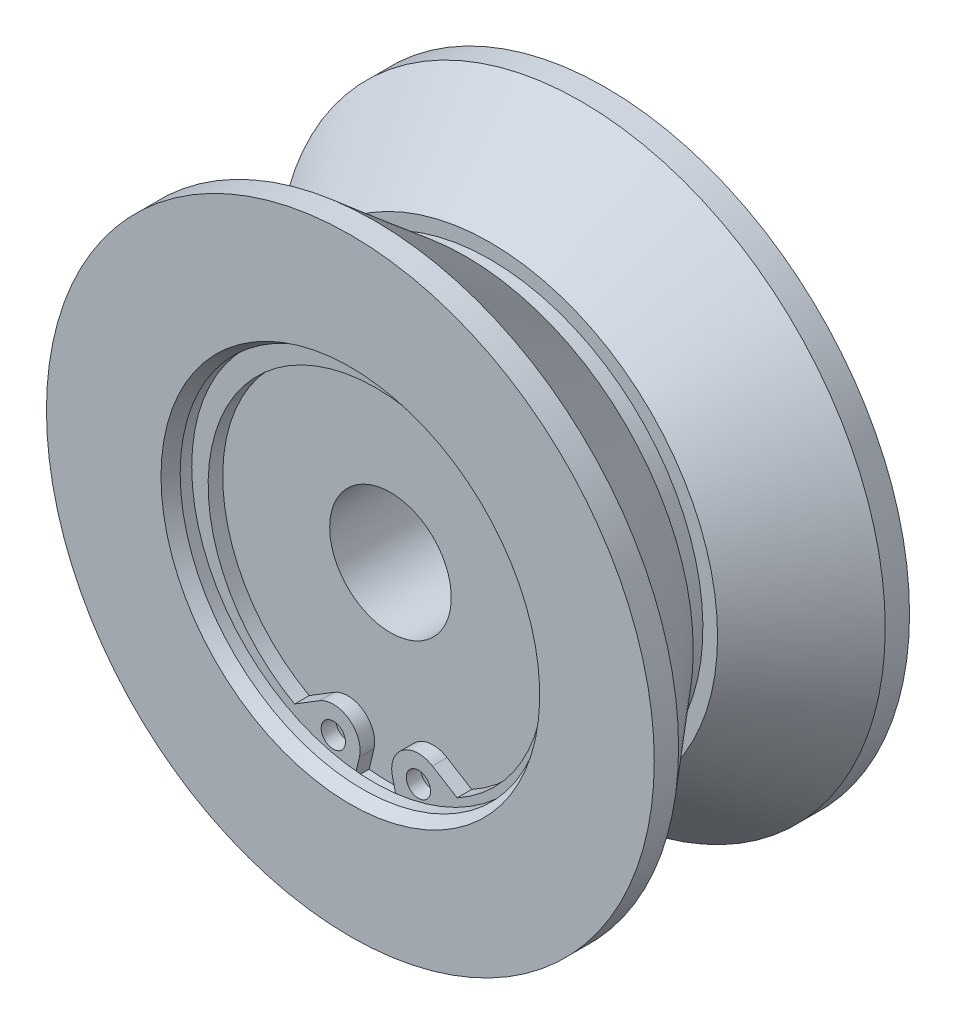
ISO-10303-21;
HEADER;
FILE_DESCRIPTION(('STEP AP214'),'2;1');
FILE_NAME('part.step','',(''),(''),'','','');
FILE_SCHEMA(('AUTOMOTIVE_DESIGN { 1 0 10303 214 1 1 1 1 }'));
ENDSEC;
DATA;
#1=APPLICATION_CONTEXT('core data for automotive mechanical design processes');
#2=APPLICATION_PROTOCOL_DEFINITION('international standard','automotive_design',2000,#1);
#3=PRODUCT_CONTEXT('',#1,'mechanical');
#4=PRODUCT('Part','Part','',(#3));
#5=PRODUCT_RELATED_PRODUCT_CATEGORY('part','',(#4));
#6=PRODUCT_DEFINITION_FORMATION('','',#4);
#7=PRODUCT_DEFINITION_CONTEXT('part definition',#1,'design');
#8=PRODUCT_DEFINITION('design','',#6,#7);
#9=PRODUCT_DEFINITION_SHAPE('','',#8);
#10=(LENGTH_UNIT() NAMED_UNIT(*) SI_UNIT(.MILLI.,.METRE.));
#11=(NAMED_UNIT(*) PLANE_ANGLE_UNIT() SI_UNIT($,.RADIAN.));
#12=(NAMED_UNIT(*) SI_UNIT($,.STERADIAN.) SOLID_ANGLE_UNIT());
#13=UNCERTAINTY_MEASURE_WITH_UNIT(LENGTH_MEASURE(1.E-05),#10,'distance_accuracy_value','');
#14=(GEOMETRIC_REPRESENTATION_CONTEXT(3) GLOBAL_UNCERTAINTY_ASSIGNED_CONTEXT((#13)) GLOBAL_UNIT_ASSIGNED_CONTEXT((#10,
#11,#12)) REPRESENTATION_CONTEXT('',''));
#15=CARTESIAN_POINT('',(0.,0.,0.));
#16=DIRECTION('',(0.,0.,1.));
#17=DIRECTION('',(1.,0.,0.));
#18=AXIS2_PLACEMENT_3D('',#15,#16,#17);
#19=CARTESIAN_POINT('',(0.,-0.75,8.4));
#20=DIRECTION('',(0.,0.,1.));
#21=DIRECTION('',(-1.,0.,0.));
#22=AXIS2_PLACEMENT_3D('',#19,#20,#21);
#23=CYLINDRICAL_SURFACE('',#22,13.8);
#24=CARTESIAN_POINT('',(0.,-0.75,7.2));
#25=DIRECTION('',(0.,0.,-1.));
#26=DIRECTION('',(0.,-1.,0.));
#27=AXIS2_PLACEMENT_3D('',#24,#25,#26);
#28=CIRCLE('',#27,13.8);
#29=CARTESIAN_POINT('',(-6.68514847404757,-12.8226463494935,7.2));
#30=VERTEX_POINT('',#29);
#31=CARTESIAN_POINT('',(6.68514847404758,-12.8226463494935,7.2));
#32=VERTEX_POINT('',#31);
#33=EDGE_CURVE('E105',#30,#32,#28,.T.);
#34=ORIENTED_EDGE('',*,*,#33,.T.);
#35=DIRECTION('',(0.,0.,-1.));
#36=VECTOR('',#35,1.);
#37=CARTESIAN_POINT('',(6.68514847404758,-12.8226463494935,8.4));
#38=LINE('',#37,#36);
#39=CARTESIAN_POINT('',(6.68514847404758,-12.8226463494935,8.4));
#40=VERTEX_POINT('',#39);
#41=EDGE_CURVE('E121',#40,#32,#38,.T.);
#42=ORIENTED_EDGE('',*,*,#41,.F.);
#43=CARTESIAN_POINT('',(0.,-0.75,8.4));
#44=DIRECTION('',(0.,0.,-1.));
#45=DIRECTION('',(0.,-1.,0.));
#46=AXIS2_PLACEMENT_3D('',#43,#44,#45);
#47=CIRCLE('',#46,13.8);
#48=CARTESIAN_POINT('',(-6.68514847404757,-12.8226463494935,8.4));
#49=VERTEX_POINT('',#48);
#50=EDGE_CURVE('E116',#49,#40,#47,.T.);
#51=ORIENTED_EDGE('',*,*,#50,.F.);
#52=DIRECTION('',(0.,0.,-1.));
#53=VECTOR('',#52,1.);
#54=CARTESIAN_POINT('',(-6.68514847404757,-12.8226463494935,8.4));
#55=LINE('',#54,#53);
#56=EDGE_CURVE('E96',#49,#30,#55,.T.);
#57=ORIENTED_EDGE('',*,*,#56,.T.);
#58=EDGE_LOOP('',(#34,#42,#51,#57));
#59=FACE_BOUND('',#58,.T.);
#60=ADVANCED_FACE('F14',(#59),#23,.F.);
#61=CARTESIAN_POINT('',(4.6535366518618,-11.5716426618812,8.4));
#62=DIRECTION('',(-0.524334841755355,-0.851512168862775,0.));
#63=DIRECTION('',(-0.851512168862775,0.524334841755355,0.));
#64=AXIS2_PLACEMENT_3D('',#61,#62,#63);
#65=PLANE('',#64);
#66=DIRECTION('',(-0.851512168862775,0.524334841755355,0.));
#67=VECTOR('',#66,1.);
#68=CARTESIAN_POINT('',(4.6535366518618,-11.5716426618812,7.2));
#69=LINE('',#68,#67);
#70=CARTESIAN_POINT('',(4.6535366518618,-11.5716426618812,7.2));
#71=VERTEX_POINT('',#70);
#72=EDGE_CURVE('E109',#32,#71,#69,.T.);
#73=ORIENTED_EDGE('',*,*,#72,.T.);
#74=DIRECTION('',(0.,0.,-1.));
#75=VECTOR('',#74,1.);
#76=CARTESIAN_POINT('',(4.6535366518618,-11.5716426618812,8.4));
#77=LINE('',#76,#75);
#78=CARTESIAN_POINT('',(4.6535366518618,-11.5716426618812,8.4));
#79=VERTEX_POINT('',#78);
#80=EDGE_CURVE('E140',#79,#71,#77,.T.);
#81=ORIENTED_EDGE('',*,*,#80,.F.);
#82=DIRECTION('',(-0.851512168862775,0.524334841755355,0.));
#83=VECTOR('',#82,1.);
#84=CARTESIAN_POINT('',(4.6535366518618,-11.5716426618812,8.4));
#85=LINE('',#84,#83);
#86=EDGE_CURVE('E143',#40,#79,#85,.T.);
#87=ORIENTED_EDGE('',*,*,#86,.F.);
#88=ORIENTED_EDGE('',*,*,#41,.T.);
#89=EDGE_LOOP('',(#73,#81,#87,#88));
#90=FACE_BOUND('',#89,.T.);
#91=ADVANCED_FACE('F279',(#90),#65,.F.);
#92=CARTESIAN_POINT('',(3.5,-13.4449694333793,8.4));
#93=DIRECTION('',(0.,0.,1.));
#94=DIRECTION('',(-1.,0.,0.));
#95=AXIS2_PLACEMENT_3D('',#92,#93,#94);
#96=CYLINDRICAL_SURFACE('',#95,2.2);
#97=CARTESIAN_POINT('',(3.5,-13.4449694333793,7.2));
#98=DIRECTION('',(0.,0.,1.));
#99=DIRECTION('',(1.,0.,0.));
#100=AXIS2_PLACEMENT_3D('',#97,#98,#99);
#101=CIRCLE('',#100,2.2);
#102=CARTESIAN_POINT('',(1.35968434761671,-13.9539379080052,7.2));
#103=VERTEX_POINT('',#102);
#104=EDGE_CURVE('E134',#71,#103,#101,.T.);
#105=ORIENTED_EDGE('',*,*,#104,.T.);
#106=DIRECTION('',(0.,0.,-1.));
#107=VECTOR('',#106,1.);
#108=CARTESIAN_POINT('',(1.35968434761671,-13.9539379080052,8.4));
#109=LINE('',#108,#107);
#110=CARTESIAN_POINT('',(1.35968434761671,-13.9539379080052,8.4));
#111=VERTEX_POINT('',#110);
#112=EDGE_CURVE('E144',#111,#103,#109,.T.);
#113=ORIENTED_EDGE('',*,*,#112,.F.);
#114=CARTESIAN_POINT('',(3.5,-13.4449694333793,8.4));
#115=DIRECTION('',(0.,0.,1.));
#116=DIRECTION('',(1.,0.,0.));
#117=AXIS2_PLACEMENT_3D('',#114,#115,#116);
#118=CIRCLE('',#117,2.2);
#119=EDGE_CURVE('E163',#79,#111,#118,.T.);
#120=ORIENTED_EDGE('',*,*,#119,.F.);
#121=ORIENTED_EDGE('',*,*,#80,.T.);
#122=EDGE_LOOP('',(#105,#113,#120,#121));
#123=FACE_BOUND('',#122,.T.);
#124=ADVANCED_FACE('F284',(#123),#96,.T.);
#125=CARTESIAN_POINT('',(-1.3596843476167,-13.9539379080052,8.4));
#126=DIRECTION('',(-0.97287075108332,0.231349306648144,0.));
#127=DIRECTION('',(0.,0.,1.));
#128=AXIS2_PLACEMENT_3D('',#125,#126,#127);
#129=PLANE('',#128);
#130=DIRECTION('',(0.,0.,-1.));
#131=VECTOR('',#130,1.);
#132=CARTESIAN_POINT('',(-1.7515909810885,-15.6019847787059,-11.5));
#133=LINE('',#132,#131);
#134=CARTESIAN_POINT('',(-1.7515909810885,-15.6019847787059,7.2));
#135=VERTEX_POINT('',#134);
#136=CARTESIAN_POINT('',(-1.7515909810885,-15.6019847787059,8.4));
#137=VERTEX_POINT('',#136);
#138=EDGE_CURVE('E102',#135,#137,#133,.F.);
#139=ORIENTED_EDGE('',*,*,#138,.F.);
#140=DIRECTION('',(0.231349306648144,0.97287075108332,0.));
#141=VECTOR('',#140,1.);
#142=CARTESIAN_POINT('',(-1.3596843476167,-13.9539379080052,7.2));
#143=LINE('',#142,#141);
#144=CARTESIAN_POINT('',(-1.3596843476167,-13.9539379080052,7.2));
#145=VERTEX_POINT('',#144);
#146=EDGE_CURVE('E147',#135,#145,#143,.T.);
#147=ORIENTED_EDGE('',*,*,#146,.T.);
#148=DIRECTION('',(0.,0.,-1.));
#149=VECTOR('',#148,1.);
#150=CARTESIAN_POINT('',(-1.3596843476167,-13.9539379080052,8.4));
#151=LINE('',#150,#149);
#152=CARTESIAN_POINT('',(-1.3596843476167,-13.9539379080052,8.4));
#153=VERTEX_POINT('',#152);
#154=EDGE_CURVE('E157',#153,#145,#151,.T.);
#155=ORIENTED_EDGE('',*,*,#154,.F.);
#156=DIRECTION('',(0.231349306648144,0.97287075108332,0.));
#157=VECTOR('',#156,1.);
#158=CARTESIAN_POINT('',(-1.3596843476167,-13.9539379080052,8.4));
#159=LINE('',#158,#157);
#160=EDGE_CURVE('E129',#137,#153,#159,.T.);
#161=ORIENTED_EDGE('',*,*,#160,.F.);
#162=EDGE_LOOP('',(#139,#147,#155,#161));
#163=FACE_BOUND('',#162,.T.);
#164=ADVANCED_FACE('F288',(#163),#129,.F.);
#165=CARTESIAN_POINT('',(0.,-0.75,8.4));
#166=DIRECTION('',(0.,0.,-1.));
#167=DIRECTION('',(0.,-1.,0.));
#168=AXIS2_PLACEMENT_3D('',#165,#166,#167);
#169=PLANE('',#168);
#170=CARTESIAN_POINT('',(3.5,-13.4449694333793,8.4));
#171=DIRECTION('',(0.,0.,1.));
#172=DIRECTION('',(1.,0.,0.));
#173=AXIS2_PLACEMENT_3D('',#170,#171,#172);
#174=CIRCLE('',#173,1.);
#175=CARTESIAN_POINT('',(4.5,-13.4449694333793,8.4));
#176=VERTEX_POINT('',#175);
#177=EDGE_CURVE('E148',#176,#176,#174,.T.);
#178=ORIENTED_EDGE('',*,*,#177,.F.);
#179=EDGE_LOOP('',(#178));
#180=FACE_BOUND('',#179,.T.);
#181=CARTESIAN_POINT('',(-3.5,-13.4449694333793,8.4));
#182=DIRECTION('',(0.,0.,-1.));
#183=DIRECTION('',(1.,0.,0.));
#184=AXIS2_PLACEMENT_3D('',#181,#182,#183);
#185=CIRCLE('',#184,1.);
#186=CARTESIAN_POINT('',(-2.5,-13.4449694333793,8.4));
#187=VERTEX_POINT('',#186);
#188=EDGE_CURVE('E130',#187,#187,#185,.T.);
#189=ORIENTED_EDGE('',*,*,#188,.T.);
#190=EDGE_LOOP('',(#189));
#191=FACE_BOUND('',#190,.T.);
#192=CARTESIAN_POINT('',(0.,0.,8.4));
#193=DIRECTION('',(0.,0.,-1.));
#194=DIRECTION('',(-1.,0.,0.));
#195=AXIS2_PLACEMENT_3D('',#192,#193,#194);
#196=CIRCLE('',#195,15.7);
#197=CARTESIAN_POINT('',(1.75159098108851,-15.6019847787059,8.4));
#198=VERTEX_POINT('',#197);
#199=EDGE_CURVE('E9',#137,#198,#196,.T.);
#200=ORIENTED_EDGE('',*,*,#199,.F.);
#201=ORIENTED_EDGE('',*,*,#160,.T.);
#202=CARTESIAN_POINT('',(-3.5,-13.4449694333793,8.4));
#203=DIRECTION('',(0.,0.,1.));
#204=DIRECTION('',(-1.,0.,0.));
#205=AXIS2_PLACEMENT_3D('',#202,#203,#204);
#206=CIRCLE('',#205,2.2);
#207=CARTESIAN_POINT('',(-4.65353665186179,-11.5716426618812,8.4));
#208=VERTEX_POINT('',#207);
#209=EDGE_CURVE('E125',#153,#208,#206,.T.);
#210=ORIENTED_EDGE('',*,*,#209,.T.);
#211=DIRECTION('',(-0.851512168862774,-0.524334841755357,0.));
#212=VECTOR('',#211,1.);
#213=CARTESIAN_POINT('',(-4.65353665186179,-11.5716426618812,8.4));
#214=LINE('',#213,#212);
#215=EDGE_CURVE('E135',#208,#49,#214,.T.);
#216=ORIENTED_EDGE('',*,*,#215,.T.);
#217=ORIENTED_EDGE('',*,*,#50,.T.);
#218=ORIENTED_EDGE('',*,*,#86,.T.);
#219=ORIENTED_EDGE('',*,*,#119,.T.);
#220=DIRECTION('',(0.231349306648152,-0.972870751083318,0.));
#221=VECTOR('',#220,1.);
#222=CARTESIAN_POINT('',(1.35968434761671,-13.9539379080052,8.4));
#223=LINE('',#222,#221);
#224=EDGE_CURVE('E167',#111,#198,#223,.T.);
#225=ORIENTED_EDGE('',*,*,#224,.T.);
#226=EDGE_LOOP('',(#200,#201,#210,#216,#217,#218,#219,#225));
#227=FACE_BOUND('',#226,.T.);
#228=ADVANCED_FACE('F291',(#180,#191,#227),#169,.F.);
#229=CARTESIAN_POINT('',(3.5,-13.4449694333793,8.4));
#230=DIRECTION('',(0.,0.,1.));
#231=DIRECTION('',(-1.,0.,0.));
#232=AXIS2_PLACEMENT_3D('',#229,#230,#231);
#233=CYLINDRICAL_SURFACE('',#232,1.);
#234=CARTESIAN_POINT('',(3.5,-13.4449694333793,7.2));
#235=DIRECTION('',(0.,0.,1.));
#236=DIRECTION('',(1.,0.,0.));
#237=AXIS2_PLACEMENT_3D('',#234,#235,#236);
#238=CIRCLE('',#237,1.);
#239=CARTESIAN_POINT('',(4.5,-13.4449694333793,7.2));
#240=VERTEX_POINT('',#239);
#241=EDGE_CURVE('E114',#240,#240,#238,.T.);
#242=ORIENTED_EDGE('',*,*,#241,.F.);
#243=EDGE_LOOP('',(#242));
#244=FACE_BOUND('',#243,.T.);
#245=ORIENTED_EDGE('',*,*,#177,.T.);
#246=EDGE_LOOP('',(#245));
#247=FACE_BOUND('',#246,.T.);
#248=ADVANCED_FACE('F293',(#244,#247),#233,.F.);
#249=CARTESIAN_POINT('',(-3.5,-13.4449694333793,8.4));
#250=DIRECTION('',(0.,0.,1.));
#251=DIRECTION('',(-1.,0.,0.));
#252=AXIS2_PLACEMENT_3D('',#249,#250,#251);
#253=CYLINDRICAL_SURFACE('',#252,1.);
#254=CARTESIAN_POINT('',(-3.5,-13.4449694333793,7.2));
#255=DIRECTION('',(0.,0.,-1.));
#256=DIRECTION('',(1.,0.,0.));
#257=AXIS2_PLACEMENT_3D('',#254,#255,#256);
#258=CIRCLE('',#257,1.);
#259=CARTESIAN_POINT('',(-2.5,-13.4449694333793,7.2));
#260=VERTEX_POINT('',#259);
#261=EDGE_CURVE('E152',#260,#260,#258,.T.);
#262=ORIENTED_EDGE('',*,*,#261,.T.);
#263=EDGE_LOOP('',(#262));
#264=FACE_BOUND('',#263,.T.);
#265=ORIENTED_EDGE('',*,*,#188,.F.);
#266=EDGE_LOOP('',(#265));
#267=FACE_BOUND('',#266,.T.);
#268=ADVANCED_FACE('F301',(#264,#267),#253,.F.);
#269=CARTESIAN_POINT('',(-4.65353665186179,-11.5716426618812,8.4));
#270=DIRECTION('',(0.524334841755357,-0.851512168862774,0.));
#271=DIRECTION('',(0.,0.,-1.));
#272=AXIS2_PLACEMENT_3D('',#269,#270,#271);
#273=PLANE('',#272);
#274=DIRECTION('',(-0.851512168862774,-0.524334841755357,0.));
#275=VECTOR('',#274,1.);
#276=CARTESIAN_POINT('',(-4.65353665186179,-11.5716426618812,7.2));
#277=LINE('',#276,#275);
#278=CARTESIAN_POINT('',(-4.65353665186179,-11.5716426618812,7.2));
#279=VERTEX_POINT('',#278);
#280=EDGE_CURVE('E92',#279,#30,#277,.T.);
#281=ORIENTED_EDGE('',*,*,#280,.T.);
#282=ORIENTED_EDGE('',*,*,#56,.F.);
#283=ORIENTED_EDGE('',*,*,#215,.F.);
#284=DIRECTION('',(0.,0.,-1.));
#285=VECTOR('',#284,1.);
#286=CARTESIAN_POINT('',(-4.65353665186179,-11.5716426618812,8.4));
#287=LINE('',#286,#285);
#288=EDGE_CURVE('E99',#208,#279,#287,.T.);
#289=ORIENTED_EDGE('',*,*,#288,.T.);
#290=EDGE_LOOP('',(#281,#282,#283,#289));
#291=FACE_BOUND('',#290,.T.);
#292=ADVANCED_FACE('F94',(#291),#273,.F.);
#293=CARTESIAN_POINT('',(-3.5,-13.4449694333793,8.4));
#294=DIRECTION('',(0.,0.,1.));
#295=DIRECTION('',(-1.,0.,0.));
#296=AXIS2_PLACEMENT_3D('',#293,#294,#295);
#297=CYLINDRICAL_SURFACE('',#296,2.2);
#298=CARTESIAN_POINT('',(-3.5,-13.4449694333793,7.2));
#299=DIRECTION('',(0.,0.,1.));
#300=DIRECTION('',(-1.,0.,0.));
#301=AXIS2_PLACEMENT_3D('',#298,#299,#300);
#302=CIRCLE('',#301,2.2);
#303=EDGE_CURVE('E154',#145,#279,#302,.T.);
#304=ORIENTED_EDGE('',*,*,#303,.T.);
#305=ORIENTED_EDGE('',*,*,#288,.F.);
#306=ORIENTED_EDGE('',*,*,#209,.F.);
#307=ORIENTED_EDGE('',*,*,#154,.T.);
#308=EDGE_LOOP('',(#304,#305,#306,#307));
#309=FACE_BOUND('',#308,.T.);
#310=ADVANCED_FACE('F271',(#309),#297,.T.);
#311=CARTESIAN_POINT('',(1.35968434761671,-13.9539379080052,8.4));
#312=DIRECTION('',(0.972870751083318,0.231349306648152,0.));
#313=DIRECTION('',(0.,0.,-1.));
#314=AXIS2_PLACEMENT_3D('',#311,#312,#313);
#315=PLANE('',#314);
#316=DIRECTION('',(0.,0.,-1.));
#317=VECTOR('',#316,1.);
#318=CARTESIAN_POINT('',(1.75159098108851,-15.6019847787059,-11.5));
#319=LINE('',#318,#317);
#320=CARTESIAN_POINT('',(1.75159098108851,-15.6019847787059,7.2));
#321=VERTEX_POINT('',#320);
#322=EDGE_CURVE('E18',#198,#321,#319,.T.);
#323=ORIENTED_EDGE('',*,*,#322,.F.);
#324=ORIENTED_EDGE('',*,*,#224,.F.);
#325=ORIENTED_EDGE('',*,*,#112,.T.);
#326=DIRECTION('',(0.231349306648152,-0.972870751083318,0.));
#327=VECTOR('',#326,1.);
#328=CARTESIAN_POINT('',(1.35968434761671,-13.9539379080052,7.2));
#329=LINE('',#328,#327);
#330=EDGE_CURVE('E32',#103,#321,#329,.T.);
#331=ORIENTED_EDGE('',*,*,#330,.T.);
#332=EDGE_LOOP('',(#323,#324,#325,#331));
#333=FACE_BOUND('',#332,.T.);
#334=ADVANCED_FACE('F262',(#333),#315,.F.);
#335=CARTESIAN_POINT('',(0.,15.7,7.2));
#336=DIRECTION('',(0.,0.,-1.));
#337=DIRECTION('',(-1.,0.,0.));
#338=AXIS2_PLACEMENT_3D('',#335,#336,#337);
#339=PLANE('',#338);
#340=ORIENTED_EDGE('',*,*,#241,.T.);
#341=EDGE_LOOP('',(#340));
#342=FACE_BOUND('',#341,.T.);
#343=ADVANCED_FACE('F259',(#342),#339,.F.);
#344=ORIENTED_EDGE('',*,*,#261,.F.);
#345=EDGE_LOOP('',(#344));
#346=FACE_BOUND('',#345,.T.);
#347=ADVANCED_FACE('F261',(#346),#339,.F.);
#348=CARTESIAN_POINT('',(0.,0.,-17.284426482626));
#349=DIRECTION('',(0.,0.,-1.));
#350=DIRECTION('',(0.,1.,0.));
#351=AXIS2_PLACEMENT_3D('',#348,#349,#350);
#352=CYLINDRICAL_SURFACE('',#351,17.5);
#353=CARTESIAN_POINT('',(0.,0.,-1.));
#354=DIRECTION('',(0.,0.,-1.));
#355=DIRECTION('',(0.,1.,0.));
#356=AXIS2_PLACEMENT_3D('',#353,#354,#355);
#357=CIRCLE('',#356,17.5);
#358=CARTESIAN_POINT('',(0.,17.5,-0.999999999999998));
#359=VERTEX_POINT('',#358);
#360=EDGE_CURVE('E196',#359,#359,#357,.T.);
#361=ORIENTED_EDGE('',*,*,#360,.F.);
#362=EDGE_LOOP('',(#361));
#363=FACE_BOUND('',#362,.T.);
#364=CARTESIAN_POINT('',(0.,0.,1.));
#365=DIRECTION('',(0.,0.,-1.));
#366=DIRECTION('',(0.,1.,0.));
#367=AXIS2_PLACEMENT_3D('',#364,#365,#366);
#368=CIRCLE('',#367,17.5);
#369=CARTESIAN_POINT('',(0.,17.5,1.));
#370=VERTEX_POINT('',#369);
#371=EDGE_CURVE('E199',#370,#370,#368,.T.);
#372=ORIENTED_EDGE('',*,*,#371,.T.);
#373=EDGE_LOOP('',(#372));
#374=FACE_BOUND('',#373,.T.);
#375=ADVANCED_FACE('F269',(#363,#374),#352,.T.);
#376=CARTESIAN_POINT('',(0.,18.7067527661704,1.));
#377=DIRECTION('',(0.,0.,1.));
#378=DIRECTION('',(0.,-1.,0.));
#379=AXIS2_PLACEMENT_3D('',#376,#377,#378);
#380=PLANE('',#379);
#381=ORIENTED_EDGE('',*,*,#371,.F.);
#382=EDGE_LOOP('',(#381));
#383=FACE_BOUND('',#382,.T.);
#384=CARTESIAN_POINT('',(0.,0.,1.));
#385=DIRECTION('',(0.,0.,-1.));
#386=DIRECTION('',(0.,1.,0.));
#387=AXIS2_PLACEMENT_3D('',#384,#385,#386);
#388=CIRCLE('',#387,18.7067527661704);
#389=CARTESIAN_POINT('',(0.,18.7067527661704,1.));
#390=VERTEX_POINT('',#389);
#391=EDGE_CURVE('E202',#390,#390,#388,.T.);
#392=ORIENTED_EDGE('',*,*,#391,.T.);
#393=EDGE_LOOP('',(#392));
#394=FACE_BOUND('',#393,.T.);
#395=ADVANCED_FACE('F312',(#383,#394),#380,.F.);
#396=CARTESIAN_POINT('',(0.,17.5,-1.));
#397=DIRECTION('',(0.,0.,-1.));
#398=DIRECTION('',(0.,1.,0.));
#399=AXIS2_PLACEMENT_3D('',#396,#397,#398);
#400=PLANE('',#399);
#401=CARTESIAN_POINT('',(0.,0.,-1.));
#402=DIRECTION('',(0.,0.,-1.));
#403=DIRECTION('',(0.,1.,0.));
#404=AXIS2_PLACEMENT_3D('',#401,#402,#403);
#405=CIRCLE('',#404,18.7067527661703);
#406=CARTESIAN_POINT('',(0.,18.7067527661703,-0.999999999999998));
#407=VERTEX_POINT('',#406);
#408=EDGE_CURVE('E193',#407,#407,#405,.T.);
#409=ORIENTED_EDGE('',*,*,#408,.F.);
#410=EDGE_LOOP('',(#409));
#411=FACE_BOUND('',#410,.T.);
#412=ORIENTED_EDGE('',*,*,#360,.T.);
#413=EDGE_LOOP('',(#412));
#414=FACE_BOUND('',#413,.T.);
#415=ADVANCED_FACE('F309',(#411,#414),#400,.F.);
#416=CARTESIAN_POINT('',(0.,0.,8.5));
#417=DIRECTION('',(0.,0.,1.));
#418=DIRECTION('',(0.,-1.,0.));
#419=AXIS2_PLACEMENT_3D('',#416,#417,#418);
#420=CONICAL_SURFACE('',#419,25.,0.69813170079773);
#421=ORIENTED_EDGE('',*,*,#391,.F.);
#422=EDGE_LOOP('',(#421));
#423=FACE_BOUND('',#422,.T.);
#424=CARTESIAN_POINT('',(0.,0.,8.5));
#425=DIRECTION('',(0.,0.,-1.));
#426=DIRECTION('',(0.,1.,0.));
#427=AXIS2_PLACEMENT_3D('',#424,#425,#426);
#428=CIRCLE('',#427,25.);
#429=CARTESIAN_POINT('',(0.,25.,8.5));
#430=VERTEX_POINT('',#429);
#431=EDGE_CURVE('E205',#430,#430,#428,.T.);
#432=ORIENTED_EDGE('',*,*,#431,.T.);
#433=EDGE_LOOP('',(#432));
#434=FACE_BOUND('',#433,.T.);
#435=ADVANCED_FACE('F307',(#423,#434),#420,.T.);
#436=CARTESIAN_POINT('',(0.,0.,-1.));
#437=DIRECTION('',(0.,0.,-1.));
#438=DIRECTION('',(0.,1.,0.));
#439=AXIS2_PLACEMENT_3D('',#436,#437,#438);
#440=CONICAL_SURFACE('',#439,18.7067527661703,0.698131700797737);
#441=CARTESIAN_POINT('',(0.,0.,-8.5));
#442=DIRECTION('',(0.,0.,-1.));
#443=DIRECTION('',(0.,1.,0.));
#444=AXIS2_PLACEMENT_3D('',#441,#442,#443);
#445=CIRCLE('',#444,25.);
#446=CARTESIAN_POINT('',(0.,25.,-8.5));
#447=VERTEX_POINT('',#446);
#448=EDGE_CURVE('E190',#447,#447,#445,.T.);
#449=ORIENTED_EDGE('',*,*,#448,.F.);
#450=EDGE_LOOP('',(#449));
#451=FACE_BOUND('',#450,.T.);
#452=ORIENTED_EDGE('',*,*,#408,.T.);
#453=EDGE_LOOP('',(#452));
#454=FACE_BOUND('',#453,.T.);
#455=ADVANCED_FACE('F303',(#451,#454),#440,.T.);
#456=CARTESIAN_POINT('',(0.,0.,10.5));
#457=DIRECTION('',(0.,0.,-1.));
#458=DIRECTION('',(-1.,0.,0.));
#459=AXIS2_PLACEMENT_3D('',#456,#457,#458);
#460=CYLINDRICAL_SURFACE('',#459,25.);
#461=ORIENTED_EDGE('',*,*,#431,.F.);
#462=EDGE_LOOP('',(#461));
#463=FACE_BOUND('',#462,.T.);
#464=CARTESIAN_POINT('',(0.,0.,10.5));
#465=DIRECTION('',(0.,0.,1.));
#466=DIRECTION('',(1.,0.,0.));
#467=AXIS2_PLACEMENT_3D('',#464,#465,#466);
#468=CIRCLE('',#467,25.);
#469=CARTESIAN_POINT('',(25.,0.,10.5));
#470=VERTEX_POINT('',#469);
#471=EDGE_CURVE('E219',#470,#470,#468,.T.);
#472=ORIENTED_EDGE('',*,*,#471,.F.);
#473=EDGE_LOOP('',(#472));
#474=FACE_BOUND('',#473,.T.);
#475=ADVANCED_FACE('F306',(#463,#474),#460,.T.);
#476=ORIENTED_EDGE('',*,*,#448,.T.);
#477=EDGE_LOOP('',(#476));
#478=FACE_BOUND('',#477,.T.);
#479=CARTESIAN_POINT('',(0.,0.,-10.5));
#480=DIRECTION('',(0.,0.,1.));
#481=DIRECTION('',(1.,0.,0.));
#482=AXIS2_PLACEMENT_3D('',#479,#480,#481);
#483=CIRCLE('',#482,25.);
#484=CARTESIAN_POINT('',(25.,0.,-10.5));
#485=VERTEX_POINT('',#484);
#486=EDGE_CURVE('E215',#485,#485,#483,.T.);
#487=ORIENTED_EDGE('',*,*,#486,.T.);
#488=EDGE_LOOP('',(#487));
#489=FACE_BOUND('',#488,.T.);
#490=ADVANCED_FACE('F326',(#478,#489),#460,.T.);
#491=CARTESIAN_POINT('',(0.,0.,10.5));
#492=DIRECTION('',(0.,0.,1.));
#493=DIRECTION('',(1.,0.,0.));
#494=AXIS2_PLACEMENT_3D('',#491,#492,#493);
#495=PLANE('',#494);
#496=CARTESIAN_POINT('',(0.,0.,10.5));
#497=DIRECTION('',(0.,0.,-1.));
#498=DIRECTION('',(-1.,0.,0.));
#499=AXIS2_PLACEMENT_3D('',#496,#497,#498);
#500=CIRCLE('',#499,15.5773502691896);
#501=CARTESIAN_POINT('',(-15.5773502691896,0.,10.5));
#502=VERTEX_POINT('',#501);
#503=EDGE_CURVE('E153',#502,#502,#500,.T.);
#504=ORIENTED_EDGE('',*,*,#503,.T.);
#505=EDGE_LOOP('',(#504));
#506=FACE_BOUND('',#505,.T.);
#507=ORIENTED_EDGE('',*,*,#471,.T.);
#508=EDGE_LOOP('',(#507));
#509=FACE_BOUND('',#508,.T.);
#510=ADVANCED_FACE('F329',(#506,#509),#495,.T.);
#511=CARTESIAN_POINT('',(0.,0.,-10.5));
#512=DIRECTION('',(0.,0.,1.));
#513=DIRECTION('',(1.,0.,0.));
#514=AXIS2_PLACEMENT_3D('',#511,#512,#513);
#515=PLANE('',#514);
#516=CARTESIAN_POINT('',(0.,0.,-10.5));
#517=DIRECTION('',(0.,0.,-1.));
#518=DIRECTION('',(-1.,0.,0.));
#519=AXIS2_PLACEMENT_3D('',#516,#517,#518);
#520=CIRCLE('',#519,12.);
#521=CARTESIAN_POINT('',(-12.,0.,-10.5));
#522=VERTEX_POINT('',#521);
#523=EDGE_CURVE('E218',#522,#522,#520,.T.);
#524=ORIENTED_EDGE('',*,*,#523,.F.);
#525=EDGE_LOOP('',(#524));
#526=FACE_BOUND('',#525,.T.);
#527=ORIENTED_EDGE('',*,*,#486,.F.);
#528=EDGE_LOOP('',(#527));
#529=FACE_BOUND('',#528,.T.);
#530=ADVANCED_FACE('F331',(#526,#529),#515,.F.);
#531=CARTESIAN_POINT('',(0.,0.,9.5));
#532=DIRECTION('',(0.,0.,1.));
#533=DIRECTION('',(1.,0.,0.));
#534=AXIS2_PLACEMENT_3D('',#531,#532,#533);
#535=CONICAL_SURFACE('',#534,15.,0.5235987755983);
#536=ORIENTED_EDGE('',*,*,#503,.F.);
#537=EDGE_LOOP('',(#536));
#538=FACE_BOUND('',#537,.T.);
#539=CARTESIAN_POINT('',(0.,0.,9.5));
#540=DIRECTION('',(0.,0.,-1.));
#541=DIRECTION('',(-1.,0.,0.));
#542=AXIS2_PLACEMENT_3D('',#539,#540,#541);
#543=CIRCLE('',#542,15.);
#544=CARTESIAN_POINT('',(-15.,0.,9.5));
#545=VERTEX_POINT('',#544);
#546=EDGE_CURVE('E233',#545,#545,#543,.T.);
#547=ORIENTED_EDGE('',*,*,#546,.T.);
#548=EDGE_LOOP('',(#547));
#549=FACE_BOUND('',#548,.T.);
#550=ADVANCED_FACE('F334',(#538,#549),#535,.F.);
#551=CARTESIAN_POINT('',(0.,0.,-11.5));
#552=DIRECTION('',(0.,0.,-1.));
#553=DIRECTION('',(-1.,0.,0.));
#554=AXIS2_PLACEMENT_3D('',#551,#552,#553);
#555=CYLINDRICAL_SURFACE('',#554,12.);
#556=CARTESIAN_POINT('',(0.,0.,-7.2));
#557=DIRECTION('',(0.,0.,1.));
#558=DIRECTION('',(1.,0.,0.));
#559=AXIS2_PLACEMENT_3D('',#556,#557,#558);
#560=CIRCLE('',#559,12.);
#561=CARTESIAN_POINT('',(12.,0.,-7.2));
#562=VERTEX_POINT('',#561);
#563=EDGE_CURVE('E214',#562,#562,#560,.T.);
#564=ORIENTED_EDGE('',*,*,#563,.T.);
#565=EDGE_LOOP('',(#564));
#566=FACE_BOUND('',#565,.T.);
#567=ORIENTED_EDGE('',*,*,#523,.T.);
#568=EDGE_LOOP('',(#567));
#569=FACE_BOUND('',#568,.T.);
#570=ADVANCED_FACE('F241',(#566,#569),#555,.F.);
#571=CARTESIAN_POINT('',(0.,0.,-11.5));
#572=DIRECTION('',(0.,0.,-1.));
#573=DIRECTION('',(-1.,0.,0.));
#574=AXIS2_PLACEMENT_3D('',#571,#572,#573);
#575=CYLINDRICAL_SURFACE('',#574,15.);
#576=ORIENTED_EDGE('',*,*,#546,.F.);
#577=EDGE_LOOP('',(#576));
#578=FACE_BOUND('',#577,.T.);
#579=CARTESIAN_POINT('',(0.,0.,8.55));
#580=DIRECTION('',(0.,0.,-1.));
#581=DIRECTION('',(-1.,0.,0.));
#582=AXIS2_PLACEMENT_3D('',#579,#580,#581);
#583=CIRCLE('',#582,15.);
#584=CARTESIAN_POINT('',(-15.,0.,8.55));
#585=VERTEX_POINT('',#584);
#586=EDGE_CURVE('E230',#585,#585,#583,.T.);
#587=ORIENTED_EDGE('',*,*,#586,.T.);
#588=EDGE_LOOP('',(#587));
#589=FACE_BOUND('',#588,.T.);
#590=ADVANCED_FACE('F246',(#578,#589),#575,.F.);
#591=CARTESIAN_POINT('',(0.,11.5,-7.2));
#592=DIRECTION('',(0.,0.,1.));
#593=DIRECTION('',(1.,0.,0.));
#594=AXIS2_PLACEMENT_3D('',#591,#592,#593);
#595=PLANE('',#594);
#596=CARTESIAN_POINT('',(0.,0.,-7.20000000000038));
#597=DIRECTION('',(0.,0.,-1.));
#598=DIRECTION('',(-1.,0.,0.));
#599=AXIS2_PLACEMENT_3D('',#596,#597,#598);
#600=CIRCLE('',#599,5.);
#601=CARTESIAN_POINT('',(-5.,0.,-7.20000000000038));
#602=VERTEX_POINT('',#601);
#603=EDGE_CURVE('E208',#602,#602,#600,.T.);
#604=ORIENTED_EDGE('',*,*,#603,.F.);
#605=EDGE_LOOP('',(#604));
#606=FACE_BOUND('',#605,.T.);
#607=ORIENTED_EDGE('',*,*,#563,.F.);
#608=EDGE_LOOP('',(#607));
#609=FACE_BOUND('',#608,.T.);
#610=ADVANCED_FACE('F16',(#606,#609),#595,.F.);
#611=CARTESIAN_POINT('',(0.,15.,8.55));
#612=DIRECTION('',(0.,0.,1.));
#613=DIRECTION('',(1.,0.,0.));
#614=AXIS2_PLACEMENT_3D('',#611,#612,#613);
#615=PLANE('',#614);
#616=ORIENTED_EDGE('',*,*,#586,.F.);
#617=EDGE_LOOP('',(#616));
#618=FACE_BOUND('',#617,.T.);
#619=CARTESIAN_POINT('',(0.,0.,8.55));
#620=DIRECTION('',(0.,0.,-1.));
#621=DIRECTION('',(-1.,0.,0.));
#622=AXIS2_PLACEMENT_3D('',#619,#620,#621);
#623=CIRCLE('',#622,15.7);
#624=CARTESIAN_POINT('',(-15.7,0.,8.55));
#625=VERTEX_POINT('',#624);
#626=EDGE_CURVE('E227',#625,#625,#623,.T.);
#627=ORIENTED_EDGE('',*,*,#626,.T.);
#628=EDGE_LOOP('',(#627));
#629=FACE_BOUND('',#628,.T.);
#630=ADVANCED_FACE('F245',(#618,#629),#615,.F.);
#631=CARTESIAN_POINT('',(0.,0.,-11.5));
#632=DIRECTION('',(0.,0.,-1.));
#633=DIRECTION('',(-1.,0.,0.));
#634=AXIS2_PLACEMENT_3D('',#631,#632,#633);
#635=CYLINDRICAL_SURFACE('',#634,15.7);
#636=ORIENTED_EDGE('',*,*,#626,.F.);
#637=EDGE_LOOP('',(#636));
#638=FACE_BOUND('',#637,.T.);
#639=ORIENTED_EDGE('',*,*,#199,.T.);
#640=ORIENTED_EDGE('',*,*,#322,.T.);
#641=CARTESIAN_POINT('',(0.,0.,7.2));
#642=DIRECTION('',(0.,0.,-1.));
#643=DIRECTION('',(-1.,0.,0.));
#644=AXIS2_PLACEMENT_3D('',#641,#642,#643);
#645=CIRCLE('',#644,15.7);
#646=EDGE_CURVE('E224',#321,#135,#645,.T.);
#647=ORIENTED_EDGE('',*,*,#646,.T.);
#648=ORIENTED_EDGE('',*,*,#138,.T.);
#649=EDGE_LOOP('',(#639,#640,#647,#648));
#650=FACE_BOUND('',#649,.T.);
#651=ADVANCED_FACE('F253',(#638,#650),#635,.F.);
#652=CARTESIAN_POINT('',(0.,0.,-16.6830252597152));
#653=DIRECTION('',(0.,0.,-1.));
#654=DIRECTION('',(-1.,0.,0.));
#655=AXIS2_PLACEMENT_3D('',#652,#653,#654);
#656=CYLINDRICAL_SURFACE('',#655,5.);
#657=ORIENTED_EDGE('',*,*,#603,.T.);
#658=EDGE_LOOP('',(#657));
#659=FACE_BOUND('',#658,.T.);
#660=CARTESIAN_POINT('',(0.,0.,7.2));
#661=DIRECTION('',(0.,0.,-1.));
#662=DIRECTION('',(-1.,0.,0.));
#663=AXIS2_PLACEMENT_3D('',#660,#661,#662);
#664=CIRCLE('',#663,5.);
#665=CARTESIAN_POINT('',(-5.,0.,7.2));
#666=VERTEX_POINT('',#665);
#667=EDGE_CURVE('E211',#666,#666,#664,.T.);
#668=ORIENTED_EDGE('',*,*,#667,.F.);
#669=EDGE_LOOP('',(#668));
#670=FACE_BOUND('',#669,.T.);
#671=ADVANCED_FACE('F276',(#659,#670),#656,.F.);
#672=ORIENTED_EDGE('',*,*,#667,.T.);
#673=EDGE_LOOP('',(#672));
#674=FACE_BOUND('',#673,.T.);
#675=ORIENTED_EDGE('',*,*,#646,.F.);
#676=ORIENTED_EDGE('',*,*,#330,.F.);
#677=ORIENTED_EDGE('',*,*,#104,.F.);
#678=ORIENTED_EDGE('',*,*,#72,.F.);
#679=ORIENTED_EDGE('',*,*,#33,.F.);
#680=ORIENTED_EDGE('',*,*,#280,.F.);
#681=ORIENTED_EDGE('',*,*,#303,.F.);
#682=ORIENTED_EDGE('',*,*,#146,.F.);
#683=EDGE_LOOP('',(#675,#676,#677,#678,#679,#680,#681,#682));
#684=FACE_BOUND('',#683,.T.);
#685=ADVANCED_FACE('F107',(#674,#684),#339,.F.);
#686=CLOSED_SHELL('',(#60,#91,#124,#164,#228,#248,#268,#292,#310,#334,#343,#347,#375,#395,#415,
#435,#455,#475,#490,#510,#530,#550,#570,#590,#610,#630,#651,#671,#685));
#687=MANIFOLD_SOLID_BREP('B1',#686);
#688=ADVANCED_BREP_SHAPE_REPRESENTATION('',(#18,#687),#14);
#689=SHAPE_DEFINITION_REPRESENTATION(#9,#688);
ENDSEC;
END-ISO-10303-21;
